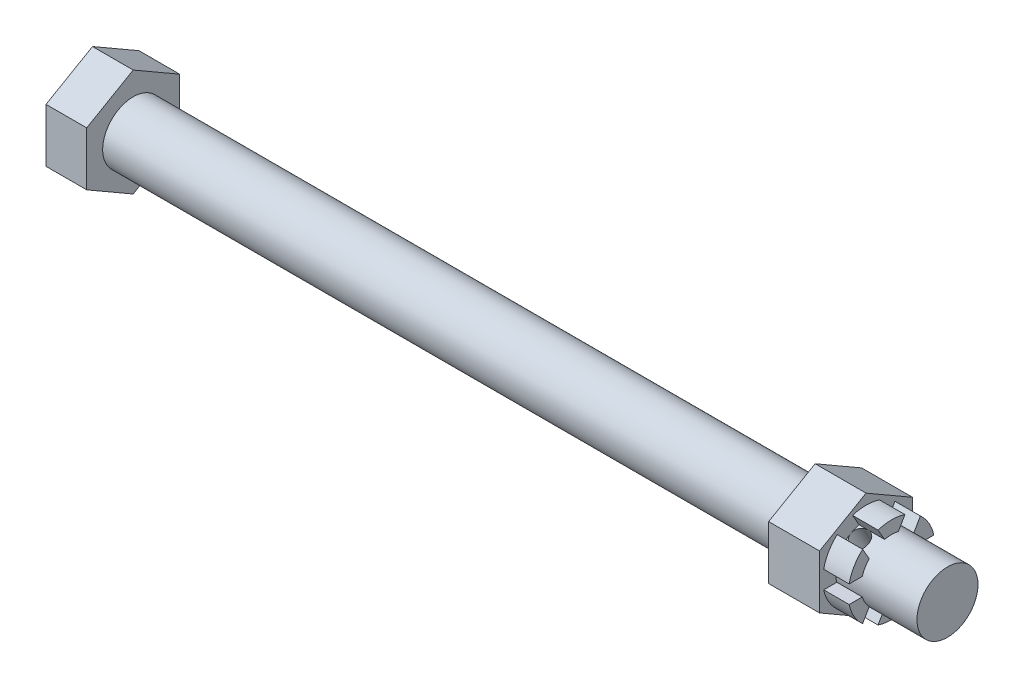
from build123d import *
from build123d.topology import SkipClean

# Parameters (mm, degrees)
BOSS_EXTRU_1_DEPTH      = 8
ESQUISSE3_OUTSIDE_W     = 57.226000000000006
ESQUISSE3_OUTSIDE_H     = 57.226000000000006
ENL_V_MAT_EXTRU_2_DEPTH = 153.73049793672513
ENL_V_MAT_EXTRU_3_DEPTH = 5
ESQUISSE5_R             = 1.7500000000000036
ENL_V_MAT_EXTRU_4_DEPTH = 104.21652103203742


with BuildPart() as part:
    # Esquisse1 → Base-R_volution (revolve)
    with BuildSketch(Plane.XY, mode=Mode.PRIVATE) as base_r_volution_sk:
        Polygon((-92.62287681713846, 6), (41.37712318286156, 5.999999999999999), (41.377123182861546, 10.550000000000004), (51.37712318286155, 10.550000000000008), (51.37712318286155, 8.5), (56.377123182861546, 8.5), (56.37712318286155, 6), (67.37712318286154, 6), (67.37712318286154, 0), (-92.62287681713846, 0), align=None)
    revolve(base_r_volution_sk.sketch.rotate(Axis((85.18814078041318, 0, 0), (-1, 0, 0)), 90), axis=Axis((85.18814078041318, 0, 0), (-1, 0, 0)))

    # Esquisse2 → Boss.-Extru.1 (add)
    with BuildSketch(Plane.ZY.offset(92.62287681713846)):
        Polygon((0, 10.550000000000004), (-9.136568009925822, 5.275000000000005), (-9.136568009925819, -5.274999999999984), (1.73e-15, -10.54999999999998), (9.13656800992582, -5.274999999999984), (9.13656800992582, 5.27500000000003), align=None)
    extrude(amount=BOSS_EXTRU_1_DEPTH)

    # Esquisse3 outside → Enl_v. mat.-Extru.2 (cut, through all)
    with BuildSketch(Plane(origin=(51.37712318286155, 0, 0), x_dir=(0, 0, -1), z_dir=(1, 0, 0))):
        Rectangle(ESQUISSE3_OUTSIDE_W, ESQUISSE3_OUTSIDE_H)
        Polygon((-1.61e-15, 10.55), (-9.136568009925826, 5.275000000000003), (-9.136568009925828, -5.274999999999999), (-2e-16, -10.55), (9.136568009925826, -5.275000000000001), (9.13656800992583, 5.275000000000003), align=None, mode=Mode.SUBTRACT)
    extrude(amount=-ENL_V_MAT_EXTRU_2_DEPTH, mode=Mode.SUBTRACT)

    # Esquisse4 → Enl_v. mat.-Extru.3 (cut)
    with SkipClean():  # the faces are left unmerged after this step: merging them gives an invalid solid
        with BuildSketch(Plane(origin=(56.377123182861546, 0, 0), x_dir=(0, 0, -1), z_dir=(1, 0, 0))):
            with BuildLine():
                Line((-2.6434067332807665, 8.078514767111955), (-1.354015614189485, 5.845223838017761))
                ThreePointArc((-1.354015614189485, 5.845223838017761), (-3.000000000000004, 5.19615242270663), (-4.385104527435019, 4.09522383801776))
                Line((-4.385104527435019, 4.09522383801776), (-5.674495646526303, 6.328514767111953))
                ThreePointArc((-5.674495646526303, 6.328514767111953), (-4.250000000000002, 7.3612159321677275), (-2.6434067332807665, 8.078514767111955))
            make_face()
            with BuildLine():
                Line((4.385104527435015, -4.095223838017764), (5.674495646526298, -6.328514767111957))
                ThreePointArc((5.674495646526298, -6.328514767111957), (4.2499999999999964, -7.361215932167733), (2.643406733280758, -8.078514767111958))
                Line((2.643406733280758, -8.078514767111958), (1.354015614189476, -5.8452238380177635))
                ThreePointArc((1.354015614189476, -5.8452238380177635), (2.9999999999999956, -5.1961524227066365), (4.385104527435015, -4.095223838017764))
            make_face()
            with BuildLine():
                Line((-8.317902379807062, 1.7500000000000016), (-5.739120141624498, 1.7500000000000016))
                ThreePointArc((-5.739120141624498, 1.7500000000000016), (-6, 7.3e-16), (-5.7391201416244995, -1.7500000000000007))
                Line((-5.7391201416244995, -1.7500000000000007), (-8.317902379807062, -1.750000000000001))
                ThreePointArc((-8.317902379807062, -1.750000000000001), (-8.5, 1.04e-15), (-8.317902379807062, 1.7500000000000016))
            make_face()
            with BuildLine():
                Line((8.317902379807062, -1.749999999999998), (5.7391201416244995, -1.7499999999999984))
                ThreePointArc((5.7391201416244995, -1.7499999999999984), (6.000000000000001, 1.67e-15), (5.739120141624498, 1.750000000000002))
                Line((5.739120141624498, 1.750000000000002), (8.317902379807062, 1.7500000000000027))
                ThreePointArc((8.317902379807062, 1.7500000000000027), (8.499999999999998, 2.36e-15), (8.317902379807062, -1.749999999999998))
            make_face()
            with BuildLine():
                Line((2.6434067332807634, 8.078514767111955), (1.3540156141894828, 5.845223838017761))
                ThreePointArc((1.3540156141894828, 5.845223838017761), (3.0000000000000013, 5.196152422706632), (4.385104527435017, 4.095223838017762))
                Line((4.385104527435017, 4.095223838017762), (5.674495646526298, 6.328514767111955))
                ThreePointArc((5.674495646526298, 6.328514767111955), (4.249999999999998, 7.3612159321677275), (2.6434067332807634, 8.078514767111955))
            make_face()
            with BuildLine():
                Line((-2.64340673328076, -8.078514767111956), (-1.3540156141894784, -5.845223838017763))
                ThreePointArc((-1.3540156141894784, -5.845223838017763), (-2.999999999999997, -5.196152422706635), (-4.385104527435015, -4.0952238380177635))
                Line((-4.385104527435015, -4.0952238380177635), (-5.674495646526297, -6.328514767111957))
                ThreePointArc((-5.674495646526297, -6.328514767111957), (-4.249999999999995, -7.361215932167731), (-2.64340673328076, -8.078514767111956))
            make_face()
        extrude(amount=-ENL_V_MAT_EXTRU_3_DEPTH, mode=Mode.SUBTRACT)

    # Esquisse5 → Enl_v. mat.-Extru.4 (cut, through all)
    with BuildSketch(Plane(origin=(0, -7.912500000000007, -4.568284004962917), x_dir=(1, 0, 0), z_dir=(0, -0.8660254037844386, -0.5000000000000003))):
        with Locations(Location((53.12712318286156, -3.47e-15, 0), (0, 0, 269.999999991))):
            Circle(ESQUISSE5_R)
    extrude(amount=-ENL_V_MAT_EXTRU_4_DEPTH, mode=Mode.SUBTRACT)


solid = part.part
